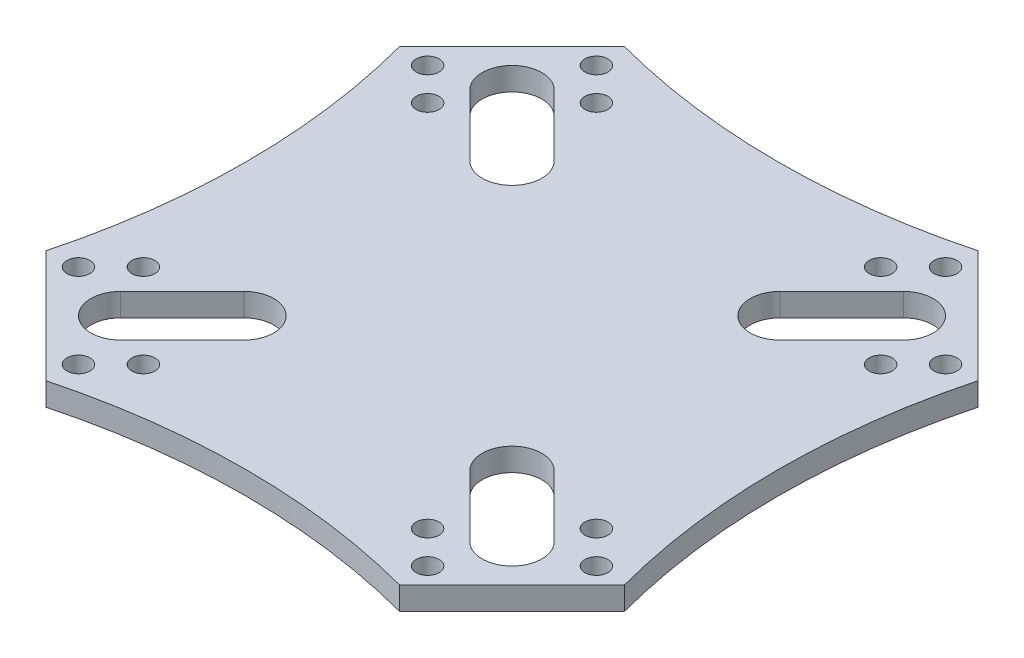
from build123d import *

# Parameters (mm, degrees)
EXTRUDE_2_DEPTH                    = 2.5
SKETCH_2_R                         = 2.5
CUT_EXTRUDE_1_DEPTH                = 90.270945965
PATTERN_LINEAR_1_COUNT             = 2
PATTERN_LINEAR_1_PITCH             = 10
PATTERN_CIRCULAR_1_COUNT           = 4
PATTERN_CIRCULAR_1_COPY_1_SKETCH_R = 2.5
PATTERN_CIRCULAR_1_COPY_1_DEPTH    = 90.270945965
PATTERN_CIRCULAR_1_COPY_2_SKETCH_R = 2.5
PATTERN_CIRCULAR_1_COPY_2_DEPTH    = 90.270945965
PATTERN_CIRCULAR_1_COPY_3_SKETCH_R = 2.5
PATTERN_CIRCULAR_1_COPY_3_DEPTH    = 90.270945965


with BuildPart() as part:
    # Sketch 1 → Extrude 2 (new, symmetric)
    with BuildSketch(Plane(origin=(0, 0, 0), x_dir=(1, 0, 0), z_dir=(0, 1, 0))):
        with BuildLine():
            Line((38.5, 63.025002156), (63.025002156, 38.5))
            ThreePointArc((63.025002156, 38.5), (58, 0), (63.025002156, -38.5))
            Line((63.025002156, -38.5), (38.5, -63.025002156))
            ThreePointArc((38.5, -63.025002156), (0, -58), (-38.5, -63.025002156))
            Line((-38.5, -63.025002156), (-63.025002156, -38.5))
            ThreePointArc((-63.025002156, -38.5), (-58, 0), (-63.025002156, 38.5))
            Line((-63.025002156, 38.5), (-38.5, 63.025002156))
            ThreePointArc((-38.5, 63.025002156), (0, 58), (38.5, 63.025002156))
        make_face()
        with BuildLine():
            Line((24.599550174, 33.791938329), (38.034579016, 47.226967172))
            ThreePointArc((38.034579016, 47.226967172), (47.226967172, 47.226967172), (47.226967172, 38.034579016))
            Line((47.226967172, 38.034579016), (33.791938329, 24.599550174))
            ThreePointArc((33.791938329, 24.599550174), (24.599550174, 24.599550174), (24.599550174, 33.791938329))
        make_face(mode=Mode.SUBTRACT)
        with BuildLine():
            Line((33.791938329, -24.599550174), (47.226967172, -38.034579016))
            ThreePointArc((47.226967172, -38.034579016), (47.226967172, -47.226967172), (38.034579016, -47.226967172))
            Line((38.034579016, -47.226967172), (24.599550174, -33.791938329))
            ThreePointArc((24.599550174, -33.791938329), (24.599550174, -24.599550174), (33.791938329, -24.599550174))
        make_face(mode=Mode.SUBTRACT)
        with BuildLine():
            Line((-24.599550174, -33.791938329), (-38.034579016, -47.226967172))
            ThreePointArc((-38.034579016, -47.226967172), (-47.226967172, -47.226967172), (-47.226967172, -38.034579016))
            Line((-47.226967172, -38.034579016), (-33.791938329, -24.599550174))
            ThreePointArc((-33.791938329, -24.599550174), (-24.599550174, -24.599550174), (-24.599550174, -33.791938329))
        make_face(mode=Mode.SUBTRACT)
        with BuildLine():
            Line((-33.791938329, 24.599550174), (-47.226967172, 38.034579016))
            ThreePointArc((-47.226967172, 38.034579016), (-47.226967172, 47.226967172), (-38.034579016, 47.226967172))
            Line((-38.034579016, 47.226967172), (-24.599550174, 33.791938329))
            ThreePointArc((-24.599550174, 33.791938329), (-24.599550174, 24.599550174), (-33.791938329, 24.599550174))
        make_face(mode=Mode.SUBTRACT)
    extrude(amount=EXTRUDE_2_DEPTH, both=True)

    # Sketch 2 → Cut-Extrude 1 (cut, through all)
    with BuildSketch(Plane(origin=(0, 2.5, 0), x_dir=(1, 0, 0), z_dir=(0, 1, 0))):
        with Locations(Location((38.034579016, 56.419355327, 0), (0, 0, 270))):
            Circle(SKETCH_2_R)
        with Locations(Location((56.419355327, 38.034579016, 0), (0, 0, 270))):
            Circle(SKETCH_2_R)
    cut_extrude_1 = extrude(amount=-CUT_EXTRUDE_1_DEPTH, mode=Mode.SUBTRACT)

    # Pattern Linear 1: Cut-Extrude 1 ×2
    with Locations(*[Vector(-0.7071067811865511, 0, 0.707106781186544) * (i * PATTERN_LINEAR_1_PITCH) for i in range(1, PATTERN_LINEAR_1_COUNT)]):
        add(cut_extrude_1, mode=Mode.SUBTRACT)

    # Pattern Circular 1: Cut-Extrude 1 ×4 about axis
    pattern_circular_1_axis = Axis((0, 0, 0), (0, 1, 0))
    for i in range(1, PATTERN_CIRCULAR_1_COUNT):
        add(cut_extrude_1.rotate(pattern_circular_1_axis, i * 360 / PATTERN_CIRCULAR_1_COUNT), mode=Mode.SUBTRACT)

    # Pattern Circular 1 copy 1 sketch → Pattern Circular 1 copy 1 (cut, through all)
    with BuildSketch(Plane(origin=(7.071067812, 2.5, 7.071067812), x_dir=(0, 0, -1), z_dir=(0, 1, 0))):
        with Locations(Location((38.034579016, 56.419355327, 0), (0, 0, 270))):
            Circle(PATTERN_CIRCULAR_1_COPY_1_SKETCH_R)
        with Locations(Location((56.419355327, 38.034579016, 0), (0, 0, 270))):
            Circle(PATTERN_CIRCULAR_1_COPY_1_SKETCH_R)
    extrude(amount=-PATTERN_CIRCULAR_1_COPY_1_DEPTH, mode=Mode.SUBTRACT)

    # Pattern Circular 1 copy 2 sketch → Pattern Circular 1 copy 2 (cut, through all)
    with BuildSketch(Plane(origin=(7.071067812, 2.5, -7.071067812), x_dir=(-1, 0, 0), z_dir=(0, 1, 0))):
        with Locations(Location((38.034579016, 56.419355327, 0), (0, 0, 270))):
            Circle(PATTERN_CIRCULAR_1_COPY_2_SKETCH_R)
        with Locations(Location((56.419355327, 38.034579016, 0), (0, 0, 270))):
            Circle(PATTERN_CIRCULAR_1_COPY_2_SKETCH_R)
    extrude(amount=-PATTERN_CIRCULAR_1_COPY_2_DEPTH, mode=Mode.SUBTRACT)

    # Pattern Circular 1 copy 3 sketch → Pattern Circular 1 copy 3 (cut, through all)
    with BuildSketch(Plane(origin=(-7.071067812, 2.5, -7.071067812), x_dir=(0, 0, 1), z_dir=(0, 1, 0))):
        with Locations(Location((38.034579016, 56.419355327, 0), (0, 0, 270))):
            Circle(PATTERN_CIRCULAR_1_COPY_3_SKETCH_R)
        with Locations(Location((56.419355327, 38.034579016, 0), (0, 0, 270))):
            Circle(PATTERN_CIRCULAR_1_COPY_3_SKETCH_R)
    extrude(amount=-PATTERN_CIRCULAR_1_COPY_3_DEPTH, mode=Mode.SUBTRACT)


solid = part.part
